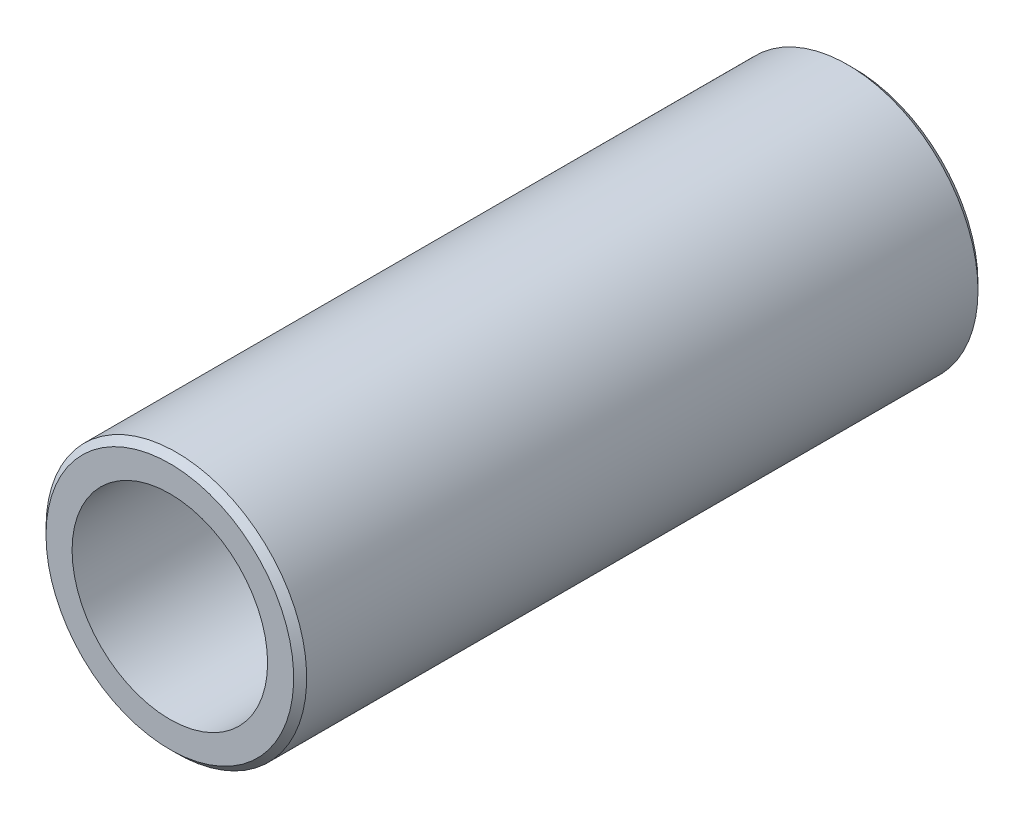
ISO-10303-21;
HEADER;
FILE_DESCRIPTION(('STEP AP214'),'2;1');
FILE_NAME('part.step','',(''),(''),'','','');
FILE_SCHEMA(('AUTOMOTIVE_DESIGN { 1 0 10303 214 1 1 1 1 }'));
ENDSEC;
DATA;
#1=APPLICATION_CONTEXT('core data for automotive mechanical design processes');
#2=APPLICATION_PROTOCOL_DEFINITION('international standard','automotive_design',2000,#1);
#3=PRODUCT_CONTEXT('',#1,'mechanical');
#4=PRODUCT('Part','Part','',(#3));
#5=PRODUCT_RELATED_PRODUCT_CATEGORY('part','',(#4));
#6=PRODUCT_DEFINITION_FORMATION('','',#4);
#7=PRODUCT_DEFINITION_CONTEXT('part definition',#1,'design');
#8=PRODUCT_DEFINITION('design','',#6,#7);
#9=PRODUCT_DEFINITION_SHAPE('','',#8);
#10=(LENGTH_UNIT() NAMED_UNIT(*) SI_UNIT(.MILLI.,.METRE.));
#11=(NAMED_UNIT(*) PLANE_ANGLE_UNIT() SI_UNIT($,.RADIAN.));
#12=(NAMED_UNIT(*) SI_UNIT($,.STERADIAN.) SOLID_ANGLE_UNIT());
#13=UNCERTAINTY_MEASURE_WITH_UNIT(LENGTH_MEASURE(1.E-05),#10,'distance_accuracy_value','');
#14=(GEOMETRIC_REPRESENTATION_CONTEXT(3) GLOBAL_UNCERTAINTY_ASSIGNED_CONTEXT((#13)) GLOBAL_UNIT_ASSIGNED_CONTEXT((#10,
#11,#12)) REPRESENTATION_CONTEXT('',''));
#15=CARTESIAN_POINT('',(0.,0.,0.));
#16=DIRECTION('',(0.,0.,1.));
#17=DIRECTION('',(1.,0.,0.));
#18=AXIS2_PLACEMENT_3D('',#15,#16,#17);
#19=CARTESIAN_POINT('',(0.,0.,105.));
#20=DIRECTION('',(0.,0.,0.999999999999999));
#21=DIRECTION('',(1.,0.,0.));
#22=AXIS2_PLACEMENT_3D('',#19,#20,#21);
#23=PLANE('',#22);
#24=CARTESIAN_POINT('',(0.,0.,105.));
#25=DIRECTION('',(0.,0.,0.999999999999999));
#26=DIRECTION('',(1.,0.,0.));
#27=AXIS2_PLACEMENT_3D('',#24,#25,#26);
#28=CIRCLE('',#27,19.);
#29=CARTESIAN_POINT('',(-19.,0.,105.));
#30=VERTEX_POINT('',#29);
#31=EDGE_CURVE('E11',#30,#30,#28,.T.);
#32=ORIENTED_EDGE('',*,*,#31,.T.);
#33=EDGE_LOOP('',(#32));
#34=FACE_BOUND('',#33,.T.);
#35=CARTESIAN_POINT('',(0.,0.,105.));
#36=DIRECTION('',(0.,0.,0.999999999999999));
#37=DIRECTION('',(1.,0.,0.));
#38=AXIS2_PLACEMENT_3D('',#35,#36,#37);
#39=CIRCLE('',#38,15.);
#40=CARTESIAN_POINT('',(-15.,0.,105.));
#41=VERTEX_POINT('',#40);
#42=EDGE_CURVE('E57',#41,#41,#39,.T.);
#43=ORIENTED_EDGE('',*,*,#42,.F.);
#44=EDGE_LOOP('',(#43));
#45=FACE_BOUND('',#44,.T.);
#46=ADVANCED_FACE('F37',(#34,#45),#23,.T.);
#47=CARTESIAN_POINT('',(0.,0.,0.));
#48=DIRECTION('',(0.,0.,0.999999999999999));
#49=DIRECTION('',(1.,0.,0.));
#50=AXIS2_PLACEMENT_3D('',#47,#48,#49);
#51=PLANE('',#50);
#52=CARTESIAN_POINT('',(0.,0.,0.));
#53=DIRECTION('',(0.,0.,0.999999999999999));
#54=DIRECTION('',(1.,0.,0.));
#55=AXIS2_PLACEMENT_3D('',#52,#53,#54);
#56=CIRCLE('',#55,19.);
#57=CARTESIAN_POINT('',(19.,0.,0.));
#58=VERTEX_POINT('',#57);
#59=EDGE_CURVE('E44',#58,#58,#56,.F.);
#60=ORIENTED_EDGE('',*,*,#59,.T.);
#61=EDGE_LOOP('',(#60));
#62=FACE_BOUND('',#61,.T.);
#63=CARTESIAN_POINT('',(0.,0.,0.));
#64=DIRECTION('',(0.,0.,0.999999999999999));
#65=DIRECTION('',(1.,0.,0.));
#66=AXIS2_PLACEMENT_3D('',#63,#64,#65);
#67=CIRCLE('',#66,15.);
#68=CARTESIAN_POINT('',(-15.,0.,0.));
#69=VERTEX_POINT('',#68);
#70=EDGE_CURVE('E60',#69,#69,#67,.T.);
#71=ORIENTED_EDGE('',*,*,#70,.T.);
#72=EDGE_LOOP('',(#71));
#73=FACE_BOUND('',#72,.T.);
#74=ADVANCED_FACE('F64',(#62,#73),#51,.F.);
#75=CARTESIAN_POINT('',(0.,0.,105.));
#76=DIRECTION('',(0.,0.,-0.999999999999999));
#77=DIRECTION('',(-1.,0.,0.));
#78=AXIS2_PLACEMENT_3D('',#75,#76,#77);
#79=CYLINDRICAL_SURFACE('',#78,20.);
#80=CARTESIAN_POINT('',(0.,0.,1.));
#81=DIRECTION('',(0.,0.,0.999999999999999));
#82=DIRECTION('',(1.,0.,0.));
#83=AXIS2_PLACEMENT_3D('',#80,#81,#82);
#84=CIRCLE('',#83,20.);
#85=CARTESIAN_POINT('',(-20.,0.,1.));
#86=VERTEX_POINT('',#85);
#87=EDGE_CURVE('E48',#86,#86,#84,.T.);
#88=CARTESIAN_POINT('',(0.,0.,104.));
#89=DIRECTION('',(0.,0.,0.999999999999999));
#90=DIRECTION('',(1.,0.,0.));
#91=AXIS2_PLACEMENT_3D('',#88,#89,#90);
#92=CIRCLE('',#91,20.);
#93=CARTESIAN_POINT('',(-20.,0.,104.));
#94=VERTEX_POINT('',#93);
#95=EDGE_CURVE('E52',#94,#94,#92,.F.);
#96=CARTESIAN_POINT('',(-20.,0.,1.));
#97=CARTESIAN_POINT('',(-20.,0.,2.07291666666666));
#98=CARTESIAN_POINT('',(-20.,0.,3.14583333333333));
#99=CARTESIAN_POINT('',(-20.,0.,5.29166666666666));
#100=CARTESIAN_POINT('',(-20.,0.,6.36458333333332));
#101=CARTESIAN_POINT('',(-20.,0.,8.51041666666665));
#102=CARTESIAN_POINT('',(-20.,0.,9.58333333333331));
#103=CARTESIAN_POINT('',(-20.,0.,11.7291666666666));
#104=CARTESIAN_POINT('',(-20.,0.,12.8020833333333));
#105=CARTESIAN_POINT('',(-20.,0.,14.9479166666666));
#106=CARTESIAN_POINT('',(-20.,0.,16.0208333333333));
#107=CARTESIAN_POINT('',(-20.,0.,18.1666666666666));
#108=CARTESIAN_POINT('',(-20.,0.,19.2395833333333));
#109=CARTESIAN_POINT('',(-20.,0.,21.3854166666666));
#110=CARTESIAN_POINT('',(-20.,0.,22.4583333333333));
#111=CARTESIAN_POINT('',(-20.,0.,24.6041666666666));
#112=CARTESIAN_POINT('',(-20.,0.,25.6770833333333));
#113=CARTESIAN_POINT('',(-20.,0.,27.8229166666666));
#114=CARTESIAN_POINT('',(-20.,0.,28.8958333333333));
#115=CARTESIAN_POINT('',(-20.,0.,31.0416666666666));
#116=CARTESIAN_POINT('',(-20.,0.,32.1145833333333));
#117=CARTESIAN_POINT('',(-20.,0.,34.2604166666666));
#118=CARTESIAN_POINT('',(-20.,0.,35.3333333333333));
#119=CARTESIAN_POINT('',(-20.,0.,37.4791666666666));
#120=CARTESIAN_POINT('',(-20.,0.,38.5520833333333));
#121=CARTESIAN_POINT('',(-20.,0.,40.6979166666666));
#122=CARTESIAN_POINT('',(-20.,0.,41.7708333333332));
#123=CARTESIAN_POINT('',(-20.,0.,43.9166666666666));
#124=CARTESIAN_POINT('',(-20.,0.,44.9895833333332));
#125=CARTESIAN_POINT('',(-20.,0.,47.1354166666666));
#126=CARTESIAN_POINT('',(-20.,0.,48.2083333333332));
#127=CARTESIAN_POINT('',(-20.,0.,50.3541666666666));
#128=CARTESIAN_POINT('',(-20.,0.,51.4270833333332));
#129=CARTESIAN_POINT('',(-20.,0.,53.5729166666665));
#130=CARTESIAN_POINT('',(-20.,0.,54.6458333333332));
#131=CARTESIAN_POINT('',(-20.,0.,56.7916666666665));
#132=CARTESIAN_POINT('',(-20.,0.,57.8645833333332));
#133=CARTESIAN_POINT('',(-20.,0.,60.0104166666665));
#134=CARTESIAN_POINT('',(-20.,0.,61.0833333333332));
#135=CARTESIAN_POINT('',(-20.,0.,63.2291666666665));
#136=CARTESIAN_POINT('',(-20.,0.,64.3020833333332));
#137=CARTESIAN_POINT('',(-20.,0.,66.4479166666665));
#138=CARTESIAN_POINT('',(-20.,0.,67.5208333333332));
#139=CARTESIAN_POINT('',(-20.,0.,69.6666666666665));
#140=CARTESIAN_POINT('',(-20.,0.,70.7395833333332));
#141=CARTESIAN_POINT('',(-20.,0.,72.8854166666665));
#142=CARTESIAN_POINT('',(-20.,0.,73.9583333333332));
#143=CARTESIAN_POINT('',(-20.,0.,76.1041666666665));
#144=CARTESIAN_POINT('',(-20.,0.,77.1770833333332));
#145=CARTESIAN_POINT('',(-20.,0.,79.3229166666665));
#146=CARTESIAN_POINT('',(-20.,0.,80.3958333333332));
#147=CARTESIAN_POINT('',(-20.,0.,82.5416666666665));
#148=CARTESIAN_POINT('',(-20.,0.,83.6145833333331));
#149=CARTESIAN_POINT('',(-20.,0.,85.7604166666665));
#150=CARTESIAN_POINT('',(-20.,0.,86.8333333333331));
#151=CARTESIAN_POINT('',(-20.,0.,88.9791666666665));
#152=CARTESIAN_POINT('',(-20.,0.,90.0520833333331));
#153=CARTESIAN_POINT('',(-20.,0.,92.1979166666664));
#154=CARTESIAN_POINT('',(-20.,0.,93.2708333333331));
#155=CARTESIAN_POINT('',(-20.,0.,95.4166666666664));
#156=CARTESIAN_POINT('',(-20.,0.,96.4895833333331));
#157=CARTESIAN_POINT('',(-20.,0.,98.6354166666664));
#158=CARTESIAN_POINT('',(-20.,0.,99.7083333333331));
#159=CARTESIAN_POINT('',(-20.,0.,101.854166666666));
#160=CARTESIAN_POINT('',(-20.,0.,102.927083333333));
#161=CARTESIAN_POINT('',(-20.,0.,104.));
#162=B_SPLINE_CURVE_WITH_KNOTS('',3,(#96,#97,#98,#99,#100,#101,#102,#103,#104,#105,#106,#107,
#108,#109,#110,#111,#112,#113,#114,#115,#116,#117,#118,#119,#120,#121,#122,#123,#124,#125,#126,
#127,#128,#129,#130,#131,#132,#133,#134,#135,#136,#137,#138,#139,#140,#141,#142,#143,#144,#145,
#146,#147,#148,#149,#150,#151,#152,#153,#154,#155,#156,#157,#158,#159,#160,#161),.UNSPECIFIED.,
.F.,.F.,(4,2,2,2,2,2,2,2,2,2,2,2,2,2,2,2,2,2,2,2,2,2,2,2,2,2,2,2,2,2,2,2,4),(0.,
3.21874999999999,6.43749999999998,9.65624999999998,12.875,16.09375,19.3125,22.5312499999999,
25.7499999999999,28.9687499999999,32.1874999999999,35.4062499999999,38.6249999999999,
41.8437499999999,45.0624999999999,48.2812499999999,51.4999999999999,54.7187499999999,
57.9374999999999,61.1562499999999,64.3749999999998,67.5937499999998,70.8124999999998,
74.0312499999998,77.2499999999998,80.4687499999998,83.6874999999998,86.9062499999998,
90.1249999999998,93.3437499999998,96.5624999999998,99.7812499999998,103.),.UNSPECIFIED.);
#163=EDGE_CURVE('BSEAM39',#86,#94,#162,.T.);
#164=ORIENTED_EDGE('',*,*,#87,.T.);
#165=ORIENTED_EDGE('',*,*,#95,.T.);
#166=ORIENTED_EDGE('',*,*,#163,.T.);
#167=ORIENTED_EDGE('',*,*,#163,.F.);
#168=EDGE_LOOP('',(#164,#166,#165,#167));
#169=FACE_BOUND('',#168,.T.);
#170=ADVANCED_FACE('F39',(#169),#79,.T.);
#171=CARTESIAN_POINT('',(0.,0.,105.));
#172=DIRECTION('',(0.,0.,-0.999999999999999));
#173=DIRECTION('',(-1.,0.,0.));
#174=AXIS2_PLACEMENT_3D('',#171,#172,#173);
#175=CYLINDRICAL_SURFACE('',#174,15.);
#176=CARTESIAN_POINT('',(-15.,0.,105.));
#177=CARTESIAN_POINT('',(-15.,0.,103.90625));
#178=CARTESIAN_POINT('',(-15.,0.,102.8125));
#179=CARTESIAN_POINT('',(-15.,0.,100.625));
#180=CARTESIAN_POINT('',(-15.,0.,99.5312499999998));
#181=CARTESIAN_POINT('',(-15.,0.,97.3437499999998));
#182=CARTESIAN_POINT('',(-15.,0.,96.2499999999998));
#183=CARTESIAN_POINT('',(-15.,0.,94.0624999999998));
#184=CARTESIAN_POINT('',(-15.,0.,92.9687499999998));
#185=CARTESIAN_POINT('',(-15.,0.,90.7812499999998));
#186=CARTESIAN_POINT('',(-15.,0.,89.6874999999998));
#187=CARTESIAN_POINT('',(-15.,0.,87.4999999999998));
#188=CARTESIAN_POINT('',(-15.,0.,86.4062499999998));
#189=CARTESIAN_POINT('',(-15.,0.,84.2187499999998));
#190=CARTESIAN_POINT('',(-15.,0.,83.1249999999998));
#191=CARTESIAN_POINT('',(-15.,0.,80.9374999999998));
#192=CARTESIAN_POINT('',(-15.,0.,79.8437499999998));
#193=CARTESIAN_POINT('',(-15.,0.,77.6562499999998));
#194=CARTESIAN_POINT('',(-15.,0.,76.5624999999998));
#195=CARTESIAN_POINT('',(-15.,0.,74.3749999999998));
#196=CARTESIAN_POINT('',(-15.,0.,73.2812499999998));
#197=CARTESIAN_POINT('',(-15.,0.,71.0937499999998));
#198=CARTESIAN_POINT('',(-15.,0.,69.9999999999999));
#199=CARTESIAN_POINT('',(-15.,0.,67.8124999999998));
#200=CARTESIAN_POINT('',(-15.,0.,66.7187499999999));
#201=CARTESIAN_POINT('',(-15.,0.,64.5312499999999));
#202=CARTESIAN_POINT('',(-15.,0.,63.4374999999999));
#203=CARTESIAN_POINT('',(-15.,0.,61.2499999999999));
#204=CARTESIAN_POINT('',(-15.,0.,60.1562499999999));
#205=CARTESIAN_POINT('',(-15.,0.,57.9687499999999));
#206=CARTESIAN_POINT('',(-15.,0.,56.8749999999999));
#207=CARTESIAN_POINT('',(-15.,0.,54.6874999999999));
#208=CARTESIAN_POINT('',(-15.,0.,53.5937499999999));
#209=CARTESIAN_POINT('',(-15.,0.,51.4062499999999));
#210=CARTESIAN_POINT('',(-15.,0.,50.3124999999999));
#211=CARTESIAN_POINT('',(-15.,0.,48.1249999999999));
#212=CARTESIAN_POINT('',(-15.,0.,47.0312499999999));
#213=CARTESIAN_POINT('',(-15.,0.,44.8437499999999));
#214=CARTESIAN_POINT('',(-15.,0.,43.7499999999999));
#215=CARTESIAN_POINT('',(-15.,0.,41.5624999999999));
#216=CARTESIAN_POINT('',(-15.,0.,40.4687499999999));
#217=CARTESIAN_POINT('',(-15.,0.,38.2812499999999));
#218=CARTESIAN_POINT('',(-15.,0.,37.1874999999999));
#219=CARTESIAN_POINT('',(-15.,0.,34.9999999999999));
#220=CARTESIAN_POINT('',(-15.,0.,33.9062499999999));
#221=CARTESIAN_POINT('',(-15.,0.,31.7187499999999));
#222=CARTESIAN_POINT('',(-15.,0.,30.6249999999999));
#223=CARTESIAN_POINT('',(-15.,0.,28.4374999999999));
#224=CARTESIAN_POINT('',(-15.,0.,27.3437499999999));
#225=CARTESIAN_POINT('',(-15.,0.,25.1562499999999));
#226=CARTESIAN_POINT('',(-15.,0.,24.0625));
#227=CARTESIAN_POINT('',(-15.,0.,21.875));
#228=CARTESIAN_POINT('',(-15.,0.,20.78125));
#229=CARTESIAN_POINT('',(-15.,0.,18.59375));
#230=CARTESIAN_POINT('',(-15.,0.,17.5));
#231=CARTESIAN_POINT('',(-15.,0.,15.3125));
#232=CARTESIAN_POINT('',(-15.,0.,14.21875));
#233=CARTESIAN_POINT('',(-15.,0.,12.03125));
#234=CARTESIAN_POINT('',(-15.,0.,10.9375));
#235=CARTESIAN_POINT('',(-15.,0.,8.74999999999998));
#236=CARTESIAN_POINT('',(-15.,0.,7.65624999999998));
#237=CARTESIAN_POINT('',(-15.,0.,5.46874999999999));
#238=CARTESIAN_POINT('',(-15.,0.,4.37499999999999));
#239=CARTESIAN_POINT('',(-15.,0.,2.1875));
#240=CARTESIAN_POINT('',(-15.,0.,1.09375));
#241=CARTESIAN_POINT('',(-15.,0.,0.));
#242=B_SPLINE_CURVE_WITH_KNOTS('',3,(#176,#177,#178,#179,#180,#181,#182,#183,#184,#185,#186,
#187,#188,#189,#190,#191,#192,#193,#194,#195,#196,#197,#198,#199,#200,#201,#202,#203,#204,#205,
#206,#207,#208,#209,#210,#211,#212,#213,#214,#215,#216,#217,#218,#219,#220,#221,#222,#223,#224,
#225,#226,#227,#228,#229,#230,#231,#232,#233,#234,#235,#236,#237,#238,#239,#240,#241),
.UNSPECIFIED.,.F.,.F.,(4,2,2,2,2,2,2,2,2,2,2,2,2,2,2,2,2,2,2,2,2,2,2,2,2,2,2,2,2,2,2,2,4),(0.,
3.28124999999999,6.56249999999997,9.84374999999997,13.125,16.40625,19.6874999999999,
22.9687499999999,26.2499999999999,29.5312499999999,32.8124999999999,36.0937499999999,
39.3749999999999,42.6562499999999,45.9374999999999,49.2187499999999,52.4999999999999,
55.7812499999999,59.0624999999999,62.3437499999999,65.6249999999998,68.9062499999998,
72.1874999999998,75.4687499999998,78.7499999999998,82.0312499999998,85.3124999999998,
88.5937499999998,91.8749999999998,95.1562499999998,98.4374999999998,101.71875,105.),.UNSPECIFIED.);
#243=EDGE_CURVE('BSEAM66',#41,#69,#242,.T.);
#244=ORIENTED_EDGE('',*,*,#42,.T.);
#245=ORIENTED_EDGE('',*,*,#70,.F.);
#246=ORIENTED_EDGE('',*,*,#243,.T.);
#247=ORIENTED_EDGE('',*,*,#243,.F.);
#248=EDGE_LOOP('',(#244,#246,#245,#247));
#249=FACE_BOUND('',#248,.T.);
#250=ADVANCED_FACE('F66',(#249),#175,.F.);
#251=CARTESIAN_POINT('',(0.,0.,1.));
#252=DIRECTION('',(0.,0.,0.999999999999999));
#253=DIRECTION('',(1.,0.,0.));
#254=AXIS2_PLACEMENT_3D('',#251,#252,#253);
#255=CONICAL_SURFACE('',#254,20.,0.78539816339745);
#256=ORIENTED_EDGE('',*,*,#59,.F.);
#257=EDGE_LOOP('',(#256));
#258=FACE_BOUND('',#257,.T.);
#259=ORIENTED_EDGE('',*,*,#87,.F.);
#260=EDGE_LOOP('',(#259));
#261=FACE_BOUND('',#260,.T.);
#262=ADVANCED_FACE('F68',(#258,#261),#255,.T.);
#263=CARTESIAN_POINT('',(0.,0.,105.));
#264=DIRECTION('',(0.,0.,-0.999999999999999));
#265=DIRECTION('',(-1.,0.,0.));
#266=AXIS2_PLACEMENT_3D('',#263,#264,#265);
#267=CONICAL_SURFACE('',#266,19.,0.785398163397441);
#268=CARTESIAN_POINT('',(-20.,0.,104.));
#269=CARTESIAN_POINT('',(-19.9895833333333,0.,104.010416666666));
#270=CARTESIAN_POINT('',(-19.9791666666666,0.,104.020833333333));
#271=CARTESIAN_POINT('',(-19.9583333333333,0.,104.041666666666));
#272=CARTESIAN_POINT('',(-19.9479166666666,0.,104.052083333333));
#273=CARTESIAN_POINT('',(-19.9270833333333,0.,104.072916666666));
#274=CARTESIAN_POINT('',(-19.9166666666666,0.,104.083333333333));
#275=CARTESIAN_POINT('',(-19.8958333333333,0.,104.104166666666));
#276=CARTESIAN_POINT('',(-19.8854166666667,0.,104.114583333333));
#277=CARTESIAN_POINT('',(-19.8645833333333,0.,104.135416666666));
#278=CARTESIAN_POINT('',(-19.8541666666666,0.,104.145833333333));
#279=CARTESIAN_POINT('',(-19.8333333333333,0.,104.166666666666));
#280=CARTESIAN_POINT('',(-19.8229166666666,0.,104.177083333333));
#281=CARTESIAN_POINT('',(-19.8020833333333,0.,104.197916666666));
#282=CARTESIAN_POINT('',(-19.7916666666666,0.,104.208333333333));
#283=CARTESIAN_POINT('',(-19.7708333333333,0.,104.229166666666));
#284=CARTESIAN_POINT('',(-19.7604166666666,0.,104.239583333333));
#285=CARTESIAN_POINT('',(-19.7395833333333,0.,104.260416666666));
#286=CARTESIAN_POINT('',(-19.7291666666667,0.,104.270833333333));
#287=CARTESIAN_POINT('',(-19.7083333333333,0.,104.291666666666));
#288=CARTESIAN_POINT('',(-19.6979166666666,0.,104.302083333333));
#289=CARTESIAN_POINT('',(-19.6770833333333,0.,104.322916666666));
#290=CARTESIAN_POINT('',(-19.6666666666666,0.,104.333333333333));
#291=CARTESIAN_POINT('',(-19.6458333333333,0.,104.354166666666));
#292=CARTESIAN_POINT('',(-19.6354166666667,0.,104.364583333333));
#293=CARTESIAN_POINT('',(-19.6145833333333,0.,104.385416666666));
#294=CARTESIAN_POINT('',(-19.6041666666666,0.,104.395833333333));
#295=CARTESIAN_POINT('',(-19.5833333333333,0.,104.416666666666));
#296=CARTESIAN_POINT('',(-19.5729166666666,0.,104.427083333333));
#297=CARTESIAN_POINT('',(-19.5520833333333,0.,104.447916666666));
#298=CARTESIAN_POINT('',(-19.5416666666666,0.,104.458333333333));
#299=CARTESIAN_POINT('',(-19.5208333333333,0.,104.479166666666));
#300=CARTESIAN_POINT('',(-19.5104166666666,0.,104.489583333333));
#301=CARTESIAN_POINT('',(-19.4895833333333,0.,104.510416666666));
#302=CARTESIAN_POINT('',(-19.4791666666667,0.,104.520833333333));
#303=CARTESIAN_POINT('',(-19.4583333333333,0.,104.541666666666));
#304=CARTESIAN_POINT('',(-19.4479166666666,0.,104.552083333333));
#305=CARTESIAN_POINT('',(-19.4270833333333,0.,104.572916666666));
#306=CARTESIAN_POINT('',(-19.4166666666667,0.,104.583333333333));
#307=CARTESIAN_POINT('',(-19.3958333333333,0.,104.604166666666));
#308=CARTESIAN_POINT('',(-19.3854166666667,0.,104.614583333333));
#309=CARTESIAN_POINT('',(-19.3645833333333,0.,104.635416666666));
#310=CARTESIAN_POINT('',(-19.3541666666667,0.,104.645833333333));
#311=CARTESIAN_POINT('',(-19.3333333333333,0.,104.666666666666));
#312=CARTESIAN_POINT('',(-19.3229166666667,0.,104.677083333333));
#313=CARTESIAN_POINT('',(-19.3020833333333,0.,104.697916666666));
#314=CARTESIAN_POINT('',(-19.2916666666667,0.,104.708333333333));
#315=CARTESIAN_POINT('',(-19.2708333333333,0.,104.729166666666));
#316=CARTESIAN_POINT('',(-19.2604166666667,0.,104.739583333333));
#317=CARTESIAN_POINT('',(-19.2395833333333,0.,104.760416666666));
#318=CARTESIAN_POINT('',(-19.2291666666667,0.,104.770833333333));
#319=CARTESIAN_POINT('',(-19.2083333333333,0.,104.791666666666));
#320=CARTESIAN_POINT('',(-19.1979166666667,0.,104.802083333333));
#321=CARTESIAN_POINT('',(-19.1770833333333,0.,104.822916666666));
#322=CARTESIAN_POINT('',(-19.1666666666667,0.,104.833333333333));
#323=CARTESIAN_POINT('',(-19.1458333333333,0.,104.854166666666));
#324=CARTESIAN_POINT('',(-19.1354166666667,0.,104.864583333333));
#325=CARTESIAN_POINT('',(-19.1145833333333,0.,104.885416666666));
#326=CARTESIAN_POINT('',(-19.1041666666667,0.,104.895833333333));
#327=CARTESIAN_POINT('',(-19.0833333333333,0.,104.916666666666));
#328=CARTESIAN_POINT('',(-19.0729166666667,0.,104.927083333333));
#329=CARTESIAN_POINT('',(-19.0520833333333,0.,104.947916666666));
#330=CARTESIAN_POINT('',(-19.0416666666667,0.,104.958333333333));
#331=CARTESIAN_POINT('',(-19.0208333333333,0.,104.979166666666));
#332=CARTESIAN_POINT('',(-19.0104166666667,0.,104.989583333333));
#333=CARTESIAN_POINT('',(-19.,0.,105.));
#334=B_SPLINE_CURVE_WITH_KNOTS('',3,(#268,#269,#270,#271,#272,#273,#274,#275,#276,#277,#278,
#279,#280,#281,#282,#283,#284,#285,#286,#287,#288,#289,#290,#291,#292,#293,#294,#295,#296,#297,
#298,#299,#300,#301,#302,#303,#304,#305,#306,#307,#308,#309,#310,#311,#312,#313,#314,#315,#316,
#317,#318,#319,#320,#321,#322,#323,#324,#325,#326,#327,#328,#329,#330,#331,#332,#333),
.UNSPECIFIED.,.F.,.F.,(4,2,2,2,2,2,2,2,2,2,2,2,2,2,2,2,2,2,2,2,2,2,2,2,2,2,2,2,2,2,2,2,4),(0.,
0.0441941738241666,0.088388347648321,0.132582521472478,0.176776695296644,0.220970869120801,
0.265165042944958,0.309359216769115,0.353553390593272,0.397747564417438,0.441941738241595,
0.486135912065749,0.530330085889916,0.574524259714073,0.61871843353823,0.662912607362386,
0.707106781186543,0.75130095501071,0.795495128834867,0.839689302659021,0.883883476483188,
0.928077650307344,0.972271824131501,1.01646599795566,1.06066017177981,1.10485434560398,
1.14904851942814,1.1932426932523,1.23743686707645,1.28163104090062,1.32582521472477,
1.37001938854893,1.41421356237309),.UNSPECIFIED.);
#335=EDGE_CURVE('BSEAM75',#94,#30,#334,.T.);
#336=ORIENTED_EDGE('',*,*,#95,.F.);
#337=ORIENTED_EDGE('',*,*,#31,.F.);
#338=ORIENTED_EDGE('',*,*,#335,.T.);
#339=ORIENTED_EDGE('',*,*,#335,.F.);
#340=EDGE_LOOP('',(#336,#338,#337,#339));
#341=FACE_BOUND('',#340,.T.);
#342=ADVANCED_FACE('F75',(#341),#267,.T.);
#343=CLOSED_SHELL('',(#46,#74,#170,#250,#262,#342));
#344=MANIFOLD_SOLID_BREP('B2',#343);
#345=ADVANCED_BREP_SHAPE_REPRESENTATION('',(#18,#344),#14);
#346=SHAPE_DEFINITION_REPRESENTATION(#9,#345);
ENDSEC;
END-ISO-10303-21;
